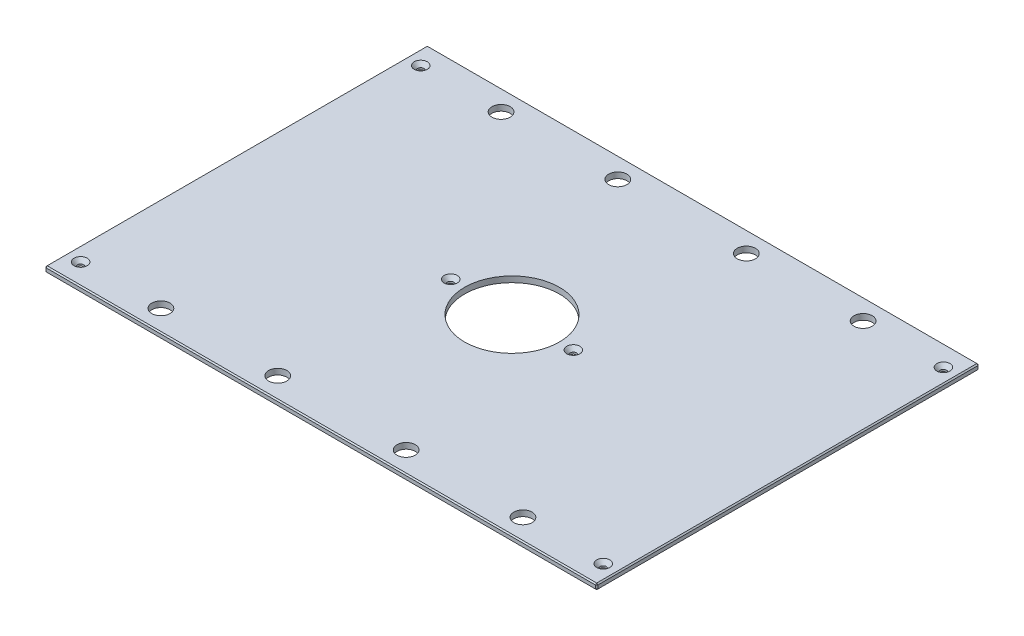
from build123d import *

# Parameters (mm, degrees)
SKETCH1_W                                     = 600.075
SKETCH1_H                                     = 415.925
BOSS_EXTRUDE1_DEPTH                           = 6.35
SKETCH13_R                                    = 51.562
CUT_EXTRUDE6_DEPTH                            = 366.118097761
F_25_32_0_78125_DIAMETER_HOLE1_D              = 19.84375
CHAMFER2_SIZE                                 = 1.27
CSK_FOR_1_4_FLAT_HEAD_MACHINE_SCREW1_AT_COUNT = 2
CSK_FOR_1_4_FLAT_HEAD_MACHINE_SCREW1_AT_PITCH = 369.88496
CSK_FOR_1_4_FLAT_HEAD_MACHINE_SCREW1_2_COUNT  = 2
CSK_FOR_1_4_FLAT_HEAD_MACHINE_SCREW1_2_PITCH  = 678.091578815
CSK_FOR_1_4_FLAT_HEAD_MACHINE_SCREW1_3_COUNT  = 2
CSK_FOR_1_4_FLAT_HEAD_MACHINE_SCREW1_3_PITCH  = 396.598880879
CSK_FOR_1_4_FLAT_HEAD_MACHINE_SCREW1_4_COUNT  = 2
CSK_FOR_1_4_FLAT_HEAD_MACHINE_SCREW1_4_PITCH  = 285.489988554
CSK_FOR_1_4_FLAT_HEAD_MACHINE_SCREW1_5_COUNT  = 2
CSK_FOR_1_4_FLAT_HEAD_MACHINE_SCREW1_5_PITCH  = 568.325
CSK_FOR_1_4_FLAT_HEAD_MACHINE_SCREW1_6_COUNT  = 2
CSK_FOR_1_4_FLAT_HEAD_MACHINE_SCREW1_6_PITCH  = 481.0125
CSK_FOR_1_4_FLAT_HEAD_MACHINE_SCREW1_7_COUNT  = 2
CSK_FOR_1_4_FLAT_HEAD_MACHINE_SCREW1_7_PITCH  = 606.784894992


with BuildPart() as part:
    # Sketch1 → Boss-Extrude1 (new body)
    with BuildSketch(Plane(origin=(0, 0, 0), x_dir=(1, 0, 0), z_dir=(0, 1, 0))):
        Rectangle(SKETCH1_W, SKETCH1_H)
    extrude(amount=BOSS_EXTRUDE1_DEPTH)

    # Sketch13 → Cut-Extrude6 (cut, through all)
    with BuildSketch(Plane(origin=(0, 6.35, 0), x_dir=(1, 0, 0), z_dir=(0, 1, 0))):
        with Locations(Location((0, 0, 0), (0, 0, 270))):
            Circle(SKETCH13_R)
    extrude(amount=-CUT_EXTRUDE6_DEPTH, mode=Mode.SUBTRACT)

    # 25_32 _0.78125_ Diameter Hole1 (through all)
    with Locations(Plane(origin=(0, 6.35, 0), x_dir=(1, 0, 0), z_dir=(0, 1, 0))):
        with Locations((196.85, 184.94248), (-196.85, 184.94248), (196.85, -184.94248), (-196.85, -184.94248), (-69.85, 184.94248), (69.85, 184.94248), (69.85, -184.94248), (-69.85, -184.94248)):
            Hole(F_25_32_0_78125_DIAMETER_HOLE1_D / 2)

    # Chamfer2
    chamfer2_edges = [part.edges().sort_by_distance(p)[0] for p in [
        (300.0375, 6.35, 0),
        (0, 6.35, -207.9625),
        (-300.0375, 6.35, 0),
        (0, 0, -207.9625),
        (300.0375, 0, 0),
        (0, 0, 207.9625),
        (-300.0375, 0, 0),
        (0, 6.35, 207.9625),
        (-300.0375, 3.175, -207.9625),
        (300.0375, 3.175, -207.9625),
        (300.0375, 3.175, 207.9625),
        (-300.0375, 3.175, 207.9625),
    ]]
    chamfer(chamfer2_edges, length=CHAMFER2_SIZE)

    # Sketch24 → CSK for 1_4 Flat Head Machine Screw1 (revolve, cut)
    with BuildSketch(Plane(origin=(284.1625, 6.35, -184.94248), x_dir=(0, 0, 1), z_dir=(1, 0, 0))):
        Polygon((0, 0), (0, 6.35), (3.3782, 6.35), (3.3782, 4.324464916), (7.1374, 0), align=None)
    csk_for_1_4_flat_head_machine_screw1 = revolve(axis=Axis((284.1625, 12.7, -184.94248), (0, -1, 0)), mode=Mode.SUBTRACT)

    # CSK for 1_4 Flat Head Machine Screw1 at: CSK for 1_4 Flat Head Machine Screw1 ×2
    with Locations(*[(0, 0, i * CSK_FOR_1_4_FLAT_HEAD_MACHINE_SCREW1_AT_PITCH) for i in range(1, CSK_FOR_1_4_FLAT_HEAD_MACHINE_SCREW1_AT_COUNT)]):
        add(csk_for_1_4_flat_head_machine_screw1, mode=Mode.SUBTRACT)

    # CSK for 1_4 Flat Head Machine Screw1 2: CSK for 1_4 Flat Head Machine Screw1 ×2
    with Locations(*[Vector(-0.8381242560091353, 0, 0.5454793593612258) * (i * CSK_FOR_1_4_FLAT_HEAD_MACHINE_SCREW1_2_PITCH) for i in range(1, CSK_FOR_1_4_FLAT_HEAD_MACHINE_SCREW1_2_COUNT)]):
        add(csk_for_1_4_flat_head_machine_screw1, mode=Mode.SUBTRACT)

    # CSK for 1_4 Flat Head Machine Screw1 3: CSK for 1_4 Flat Head Machine Screw1 ×2
    with Locations(*[Vector(-0.8846154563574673, 0, 0.4663212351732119) * (i * CSK_FOR_1_4_FLAT_HEAD_MACHINE_SCREW1_3_PITCH) for i in range(1, CSK_FOR_1_4_FLAT_HEAD_MACHINE_SCREW1_3_COUNT)]):
        add(csk_for_1_4_flat_head_machine_screw1, mode=Mode.SUBTRACT)

    # CSK for 1_4 Flat Head Machine Screw1 4: CSK for 1_4 Flat Head Machine Screw1 ×2
    with Locations(*[Vector(-0.7618042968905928, 0, 0.6478072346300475) * (i * CSK_FOR_1_4_FLAT_HEAD_MACHINE_SCREW1_4_PITCH) for i in range(1, CSK_FOR_1_4_FLAT_HEAD_MACHINE_SCREW1_4_COUNT)]):
        add(csk_for_1_4_flat_head_machine_screw1, mode=Mode.SUBTRACT)

    # CSK for 1_4 Flat Head Machine Screw1 5: CSK for 1_4 Flat Head Machine Screw1 ×2
    with Locations(*[(-i * CSK_FOR_1_4_FLAT_HEAD_MACHINE_SCREW1_5_PITCH, 0, 0) for i in range(1, CSK_FOR_1_4_FLAT_HEAD_MACHINE_SCREW1_5_COUNT)]):
        add(csk_for_1_4_flat_head_machine_screw1, mode=Mode.SUBTRACT)

    # CSK for 1_4 Flat Head Machine Screw1 6: CSK for 1_4 Flat Head Machine Screw1 ×2
    with Locations(*[(-i * CSK_FOR_1_4_FLAT_HEAD_MACHINE_SCREW1_6_PITCH, 0, 0) for i in range(1, CSK_FOR_1_4_FLAT_HEAD_MACHINE_SCREW1_6_COUNT)]):
        add(csk_for_1_4_flat_head_machine_screw1, mode=Mode.SUBTRACT)

    # CSK for 1_4 Flat Head Machine Screw1 7: CSK for 1_4 Flat Head Machine Screw1 ×2
    with Locations(*[Vector(-0.7927232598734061, 0, 0.6095816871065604) * (i * CSK_FOR_1_4_FLAT_HEAD_MACHINE_SCREW1_7_PITCH) for i in range(1, CSK_FOR_1_4_FLAT_HEAD_MACHINE_SCREW1_7_COUNT)]):
        add(csk_for_1_4_flat_head_machine_screw1, mode=Mode.SUBTRACT)


solid = part.part
